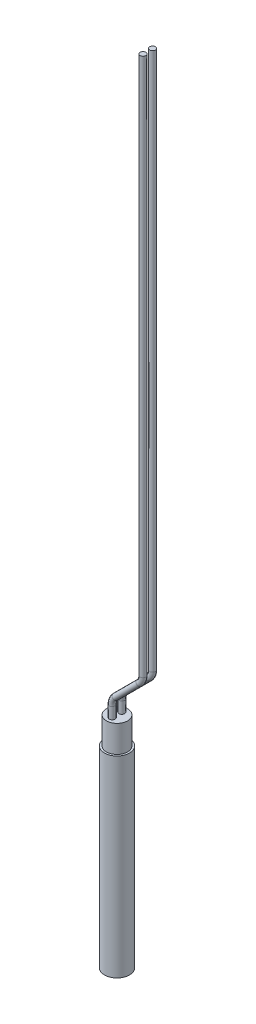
from build123d import *

# Parameters (mm, degrees)
ESQUISSE3_R = 0.75


with BuildPart() as part:
    # Esquisse1 → R_volution1 (revolve)
    with BuildSketch(Plane.XY, mode=Mode.PRIVATE) as r_volution1_sk:
        Polygon((2.75, 50), (3.25, 50), (3.25, 0), (0, 0), (0, 57), (2.75, 57), align=None)
    revolve(r_volution1_sk.sketch.rotate(Axis((0, 92.147386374, 0), (0, -1, 0)), 90), axis=Axis((0, 92.147386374, 0), (0, -1, 0)))


with BuildPart() as body_2:
    # Balayage1: sweep along a path in Esquisse2
    with BuildLine(Plane.XY) as balayage1_path:
        Line((0, 57), (0, 60))
        ThreePointArc((0, 60), (0.228361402, 61.148050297), (0.878679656, 62.121320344))
        Line((0.878679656, 62.121320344), (7.121320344, 68.363961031))
        ThreePointArc((7.121320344, 68.363961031), (7.771638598, 69.337231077), (8, 70.485281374))
        Line((8, 70.485281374), (8, 210.485281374))
    # Esquisse3 → Balayage1 (sweep)
    with BuildSketch(Plane(origin=(0, 57, 0), x_dir=(1, 0, 0), z_dir=(0, 1, 0))):
        with Locations((0, 1.25)):
            Circle(ESQUISSE3_R)
        with Locations((0, -1.25)):
            Circle(ESQUISSE3_R)
    sweep(path=balayage1_path.line)


solid = Compound([part.part, body_2.part])
